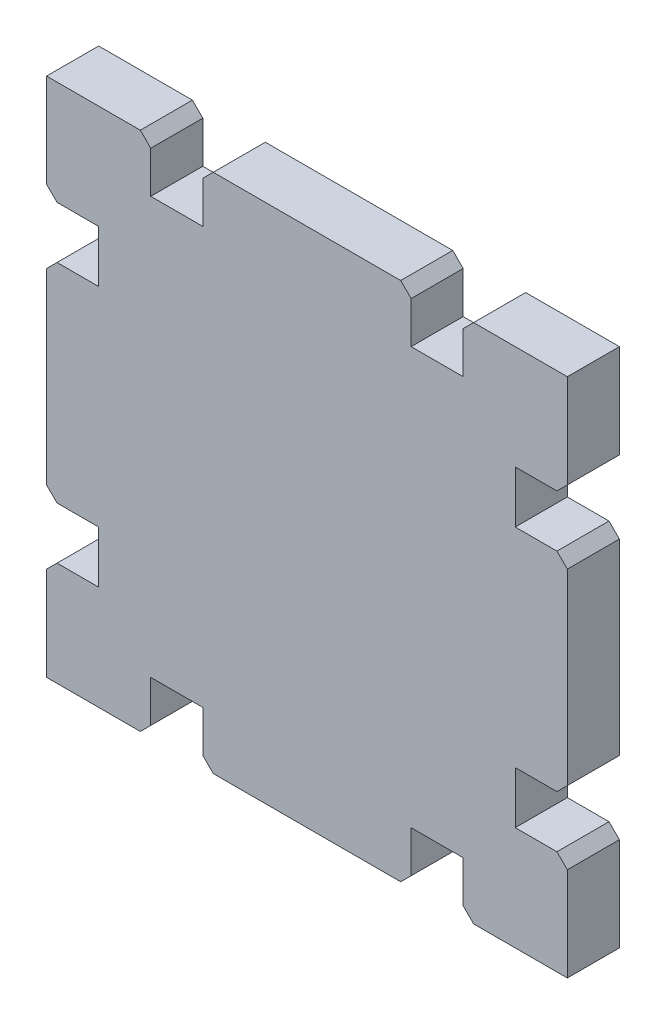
from build123d import *

# Parameters (mm, degrees)
BOSS_EXTRUDE1_DEPTH = 5


with BuildPart() as part:
    # Sketch1 → Boss-Extrude1 (new body)
    with BuildSketch(Plane.XY):
        Polygon((-25, 16), (-25, 25), (-16, 25), (-15, 24), (-15, 20), (-10, 20), (-10, 24), (-9, 25), (9, 25), (10, 24), (10, 20), (15, 20), (15, 24), (16, 25), (25, 25), (25, 16), (24, 15), (20, 15), (20, 10), (24, 10), (25, 9), (25, -9), (24, -10), (20, -10), (20, -15), (24, -15), (25, -16), (25, -25), (16, -25), (15, -24), (15, -20), (10, -20), (10, -24), (9, -25), (-9, -25), (-10, -24), (-10, -20), (-15, -20), (-15, -24), (-16, -25), (-25, -25), (-25, -16), (-24, -15), (-20, -15), (-20, -10), (-24, -10), (-25, -9), (-25, 9), (-24, 10), (-20, 10), (-20, 15), (-24, 15), align=None)
    extrude(amount=BOSS_EXTRUDE1_DEPTH)


solid = part.part
